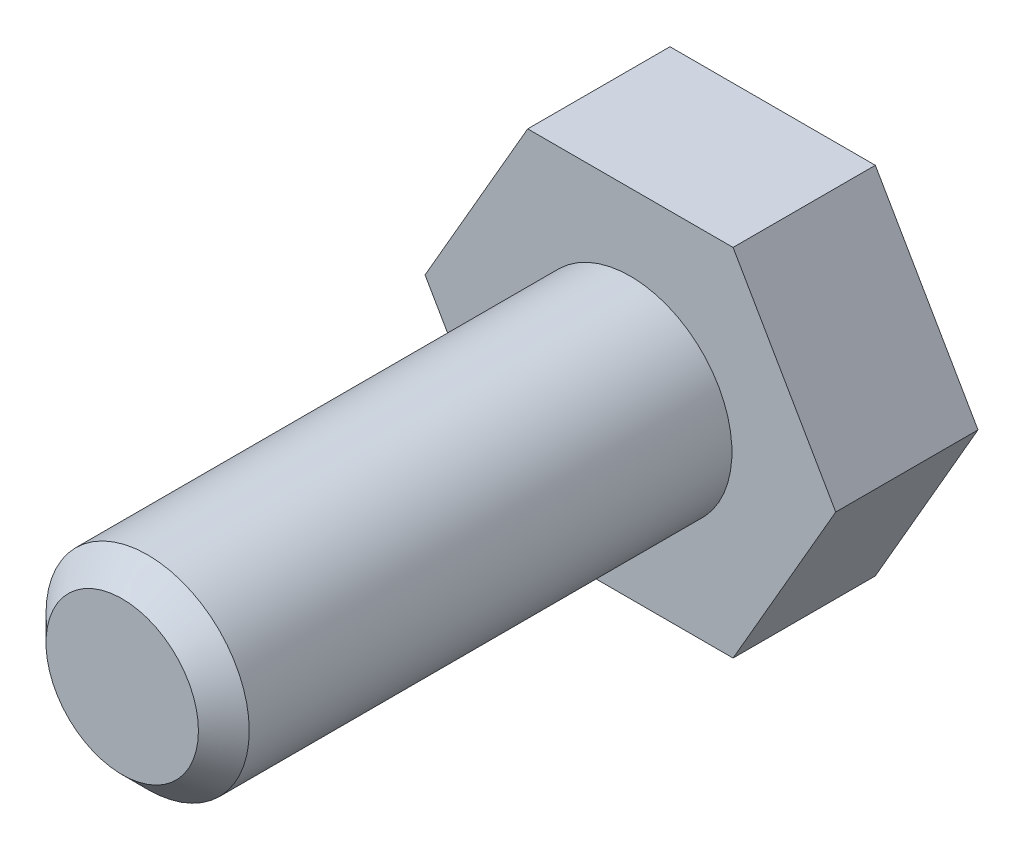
ISO-10303-21;
HEADER;
FILE_DESCRIPTION(('STEP AP214'),'2;1');
FILE_NAME('part.step','',(''),(''),'','','');
FILE_SCHEMA(('AUTOMOTIVE_DESIGN { 1 0 10303 214 1 1 1 1 }'));
ENDSEC;
DATA;
#1=APPLICATION_CONTEXT('core data for automotive mechanical design processes');
#2=APPLICATION_PROTOCOL_DEFINITION('international standard','automotive_design',2000,#1);
#3=PRODUCT_CONTEXT('',#1,'mechanical');
#4=PRODUCT('Part','Part','',(#3));
#5=PRODUCT_RELATED_PRODUCT_CATEGORY('part','',(#4));
#6=PRODUCT_DEFINITION_FORMATION('','',#4);
#7=PRODUCT_DEFINITION_CONTEXT('part definition',#1,'design');
#8=PRODUCT_DEFINITION('design','',#6,#7);
#9=PRODUCT_DEFINITION_SHAPE('','',#8);
#10=(LENGTH_UNIT() NAMED_UNIT(*) SI_UNIT(.MILLI.,.METRE.));
#11=(NAMED_UNIT(*) PLANE_ANGLE_UNIT() SI_UNIT($,.RADIAN.));
#12=(NAMED_UNIT(*) SI_UNIT($,.STERADIAN.) SOLID_ANGLE_UNIT());
#13=UNCERTAINTY_MEASURE_WITH_UNIT(LENGTH_MEASURE(1.E-05),#10,'distance_accuracy_value','');
#14=(GEOMETRIC_REPRESENTATION_CONTEXT(3) GLOBAL_UNCERTAINTY_ASSIGNED_CONTEXT((#13)) GLOBAL_UNIT_ASSIGNED_CONTEXT((#10,
#11,#12)) REPRESENTATION_CONTEXT('',''));
#15=CARTESIAN_POINT('',(0.,0.,0.));
#16=DIRECTION('',(0.,0.,1.));
#17=DIRECTION('',(1.,0.,0.));
#18=AXIS2_PLACEMENT_3D('',#15,#16,#17);
#19=CARTESIAN_POINT('',(0.,0.,2.8));
#20=DIRECTION('',(0.,0.,-1.));
#21=DIRECTION('',(-1.,0.,0.));
#22=AXIS2_PLACEMENT_3D('',#19,#20,#21);
#23=PLANE('',#22);
#24=DIRECTION('',(-0.500000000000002,-0.866025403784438,0.));
#25=VECTOR('',#24,1.);
#26=CARTESIAN_POINT('',(-4.04,0.,2.8));
#27=LINE('',#26,#25);
#28=CARTESIAN_POINT('',(-2.0192740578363,3.5,2.8));
#29=VERTEX_POINT('',#28);
#30=CARTESIAN_POINT('',(-4.04,0.,2.8));
#31=VERTEX_POINT('',#30);
#32=EDGE_CURVE('E131',#29,#31,#27,.T.);
#33=ORIENTED_EDGE('',*,*,#32,.T.);
#34=DIRECTION('',(0.5,-0.866025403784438,0.));
#35=VECTOR('',#34,1.);
#36=CARTESIAN_POINT('',(-2.01927405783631,-3.5,2.8));
#37=LINE('',#36,#35);
#38=CARTESIAN_POINT('',(-2.01927405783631,-3.5,2.8));
#39=VERTEX_POINT('',#38);
#40=EDGE_CURVE('E90',#31,#39,#37,.T.);
#41=ORIENTED_EDGE('',*,*,#40,.T.);
#42=DIRECTION('',(1.,0.,0.));
#43=VECTOR('',#42,1.);
#44=CARTESIAN_POINT('',(-2.01927405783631,-3.5,2.8));
#45=LINE('',#44,#43);
#46=CARTESIAN_POINT('',(2.02217782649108,-3.5,2.8));
#47=VERTEX_POINT('',#46);
#48=EDGE_CURVE('E103',#39,#47,#45,.T.);
#49=ORIENTED_EDGE('',*,*,#48,.T.);
#50=DIRECTION('',(0.500000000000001,0.866025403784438,0.));
#51=VECTOR('',#50,1.);
#52=CARTESIAN_POINT('',(4.04290376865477,0.,2.8));
#53=LINE('',#52,#51);
#54=CARTESIAN_POINT('',(4.04290376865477,0.,2.8));
#55=VERTEX_POINT('',#54);
#56=EDGE_CURVE('E97',#47,#55,#53,.T.);
#57=ORIENTED_EDGE('',*,*,#56,.T.);
#58=DIRECTION('',(-0.500000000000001,0.866025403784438,0.));
#59=VECTOR('',#58,1.);
#60=CARTESIAN_POINT('',(2.02217782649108,3.5,2.8));
#61=LINE('',#60,#59);
#62=CARTESIAN_POINT('',(2.02217782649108,3.5,2.8));
#63=VERTEX_POINT('',#62);
#64=EDGE_CURVE('E101',#55,#63,#61,.T.);
#65=ORIENTED_EDGE('',*,*,#64,.T.);
#66=DIRECTION('',(-1.,0.,0.));
#67=VECTOR('',#66,1.);
#68=CARTESIAN_POINT('',(-2.0192740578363,3.5,2.8));
#69=LINE('',#68,#67);
#70=EDGE_CURVE('E52',#63,#29,#69,.T.);
#71=ORIENTED_EDGE('',*,*,#70,.T.);
#72=EDGE_LOOP('',(#33,#41,#49,#57,#65,#71));
#73=FACE_BOUND('',#72,.T.);
#74=CARTESIAN_POINT('',(0.,0.,2.8));
#75=DIRECTION('',(0.,0.,-1.));
#76=DIRECTION('',(-1.,0.,0.));
#77=AXIS2_PLACEMENT_3D('',#74,#75,#76);
#78=CIRCLE('',#77,2.);
#79=CARTESIAN_POINT('',(-2.,0.,2.8));
#80=VERTEX_POINT('',#79);
#81=EDGE_CURVE('E140',#80,#80,#78,.F.);
#82=ORIENTED_EDGE('',*,*,#81,.F.);
#83=EDGE_LOOP('',(#82));
#84=FACE_BOUND('',#83,.T.);
#85=ADVANCED_FACE('F35',(#73,#84),#23,.F.);
#86=CARTESIAN_POINT('',(-4.04,0.,2.8));
#87=DIRECTION('',(0.866025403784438,-0.500000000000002,0.));
#88=DIRECTION('',(0.500000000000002,0.866025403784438,0.));
#89=AXIS2_PLACEMENT_3D('',#86,#87,#88);
#90=PLANE('',#89);
#91=DIRECTION('',(-0.500000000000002,-0.866025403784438,0.));
#92=VECTOR('',#91,1.);
#93=CARTESIAN_POINT('',(-4.04,0.,0.));
#94=LINE('',#93,#92);
#95=CARTESIAN_POINT('',(-2.0192740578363,3.5,0.));
#96=VERTEX_POINT('',#95);
#97=CARTESIAN_POINT('',(-4.04,0.,0.));
#98=VERTEX_POINT('',#97);
#99=EDGE_CURVE('E121',#96,#98,#94,.T.);
#100=ORIENTED_EDGE('',*,*,#99,.T.);
#101=DIRECTION('',(0.,0.,-1.));
#102=VECTOR('',#101,1.);
#103=CARTESIAN_POINT('',(-4.04,0.,2.8));
#104=LINE('',#103,#102);
#105=EDGE_CURVE('E138',#31,#98,#104,.T.);
#106=ORIENTED_EDGE('',*,*,#105,.F.);
#107=ORIENTED_EDGE('',*,*,#32,.F.);
#108=DIRECTION('',(0.,0.,-1.));
#109=VECTOR('',#108,1.);
#110=CARTESIAN_POINT('',(-2.0192740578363,3.5,2.8));
#111=LINE('',#110,#109);
#112=EDGE_CURVE('E117',#29,#96,#111,.T.);
#113=ORIENTED_EDGE('',*,*,#112,.T.);
#114=EDGE_LOOP('',(#100,#106,#107,#113));
#115=FACE_BOUND('',#114,.T.);
#116=ADVANCED_FACE('F156',(#115),#90,.F.);
#117=CARTESIAN_POINT('',(-2.01927405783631,-3.5,2.8));
#118=DIRECTION('',(0.866025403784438,0.5,0.));
#119=DIRECTION('',(-0.5,0.866025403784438,0.));
#120=AXIS2_PLACEMENT_3D('',#117,#118,#119);
#121=PLANE('',#120);
#122=DIRECTION('',(0.5,-0.866025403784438,0.));
#123=VECTOR('',#122,1.);
#124=CARTESIAN_POINT('',(-2.01927405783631,-3.5,0.));
#125=LINE('',#124,#123);
#126=CARTESIAN_POINT('',(-2.01927405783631,-3.5,0.));
#127=VERTEX_POINT('',#126);
#128=EDGE_CURVE('E124',#98,#127,#125,.T.);
#129=ORIENTED_EDGE('',*,*,#128,.T.);
#130=DIRECTION('',(0.,0.,-1.));
#131=VECTOR('',#130,1.);
#132=CARTESIAN_POINT('',(-2.01927405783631,-3.5,2.8));
#133=LINE('',#132,#131);
#134=EDGE_CURVE('E135',#39,#127,#133,.T.);
#135=ORIENTED_EDGE('',*,*,#134,.F.);
#136=ORIENTED_EDGE('',*,*,#40,.F.);
#137=ORIENTED_EDGE('',*,*,#105,.T.);
#138=EDGE_LOOP('',(#129,#135,#136,#137));
#139=FACE_BOUND('',#138,.T.);
#140=ADVANCED_FACE('F161',(#139),#121,.F.);
#141=CARTESIAN_POINT('',(-2.01927405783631,-3.5,2.8));
#142=DIRECTION('',(0.,1.,0.));
#143=DIRECTION('',(0.,0.,1.));
#144=AXIS2_PLACEMENT_3D('',#141,#142,#143);
#145=PLANE('',#144);
#146=DIRECTION('',(1.,0.,0.));
#147=VECTOR('',#146,1.);
#148=CARTESIAN_POINT('',(-2.01927405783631,-3.5,0.));
#149=LINE('',#148,#147);
#150=CARTESIAN_POINT('',(2.02217782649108,-3.5,0.));
#151=VERTEX_POINT('',#150);
#152=EDGE_CURVE('E126',#127,#151,#149,.T.);
#153=ORIENTED_EDGE('',*,*,#152,.T.);
#154=DIRECTION('',(0.,0.,-1.));
#155=VECTOR('',#154,1.);
#156=CARTESIAN_POINT('',(2.02217782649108,-3.5,2.8));
#157=LINE('',#156,#155);
#158=EDGE_CURVE('E112',#47,#151,#157,.T.);
#159=ORIENTED_EDGE('',*,*,#158,.F.);
#160=ORIENTED_EDGE('',*,*,#48,.F.);
#161=ORIENTED_EDGE('',*,*,#134,.T.);
#162=EDGE_LOOP('',(#153,#159,#160,#161));
#163=FACE_BOUND('',#162,.T.);
#164=ADVANCED_FACE('F176',(#163),#145,.F.);
#165=CARTESIAN_POINT('',(4.04290376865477,0.,2.8));
#166=DIRECTION('',(-0.866025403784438,0.500000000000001,0.));
#167=DIRECTION('',(-0.500000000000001,-0.866025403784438,0.));
#168=AXIS2_PLACEMENT_3D('',#165,#166,#167);
#169=PLANE('',#168);
#170=DIRECTION('',(0.500000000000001,0.866025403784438,0.));
#171=VECTOR('',#170,1.);
#172=CARTESIAN_POINT('',(4.04290376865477,0.,0.));
#173=LINE('',#172,#171);
#174=CARTESIAN_POINT('',(4.04290376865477,0.,0.));
#175=VERTEX_POINT('',#174);
#176=EDGE_CURVE('E111',#151,#175,#173,.T.);
#177=ORIENTED_EDGE('',*,*,#176,.T.);
#178=DIRECTION('',(0.,0.,-1.));
#179=VECTOR('',#178,1.);
#180=CARTESIAN_POINT('',(4.04290376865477,0.,2.8));
#181=LINE('',#180,#179);
#182=EDGE_CURVE('E108',#55,#175,#181,.T.);
#183=ORIENTED_EDGE('',*,*,#182,.F.);
#184=ORIENTED_EDGE('',*,*,#56,.F.);
#185=ORIENTED_EDGE('',*,*,#158,.T.);
#186=EDGE_LOOP('',(#177,#183,#184,#185));
#187=FACE_BOUND('',#186,.T.);
#188=ADVANCED_FACE('F109',(#187),#169,.F.);
#189=CARTESIAN_POINT('',(2.02217782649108,3.5,2.8));
#190=DIRECTION('',(-0.866025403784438,-0.500000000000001,0.));
#191=DIRECTION('',(0.500000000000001,-0.866025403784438,0.));
#192=AXIS2_PLACEMENT_3D('',#189,#190,#191);
#193=PLANE('',#192);
#194=DIRECTION('',(-0.500000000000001,0.866025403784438,0.));
#195=VECTOR('',#194,1.);
#196=CARTESIAN_POINT('',(2.02217782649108,3.5,0.));
#197=LINE('',#196,#195);
#198=CARTESIAN_POINT('',(2.02217782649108,3.5,0.));
#199=VERTEX_POINT('',#198);
#200=EDGE_CURVE('E75',#175,#199,#197,.T.);
#201=ORIENTED_EDGE('',*,*,#200,.T.);
#202=DIRECTION('',(0.,0.,-1.));
#203=VECTOR('',#202,1.);
#204=CARTESIAN_POINT('',(2.02217782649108,3.5,2.8));
#205=LINE('',#204,#203);
#206=EDGE_CURVE('E113',#63,#199,#205,.T.);
#207=ORIENTED_EDGE('',*,*,#206,.F.);
#208=ORIENTED_EDGE('',*,*,#64,.F.);
#209=ORIENTED_EDGE('',*,*,#182,.T.);
#210=EDGE_LOOP('',(#201,#207,#208,#209));
#211=FACE_BOUND('',#210,.T.);
#212=ADVANCED_FACE('F115',(#211),#193,.F.);
#213=CARTESIAN_POINT('',(-2.0192740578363,3.5,2.8));
#214=DIRECTION('',(0.,-1.,0.));
#215=DIRECTION('',(0.,0.,-1.));
#216=AXIS2_PLACEMENT_3D('',#213,#214,#215);
#217=PLANE('',#216);
#218=DIRECTION('',(-1.,0.,0.));
#219=VECTOR('',#218,1.);
#220=CARTESIAN_POINT('',(-2.0192740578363,3.5,0.));
#221=LINE('',#220,#219);
#222=EDGE_CURVE('E81',#199,#96,#221,.T.);
#223=ORIENTED_EDGE('',*,*,#222,.T.);
#224=ORIENTED_EDGE('',*,*,#112,.F.);
#225=ORIENTED_EDGE('',*,*,#70,.F.);
#226=ORIENTED_EDGE('',*,*,#206,.T.);
#227=EDGE_LOOP('',(#223,#224,#225,#226));
#228=FACE_BOUND('',#227,.T.);
#229=ADVANCED_FACE('F168',(#228),#217,.F.);
#230=CARTESIAN_POINT('',(0.,0.,0.));
#231=DIRECTION('',(0.,0.,-1.));
#232=DIRECTION('',(-1.,0.,0.));
#233=AXIS2_PLACEMENT_3D('',#230,#231,#232);
#234=PLANE('',#233);
#235=ORIENTED_EDGE('',*,*,#99,.F.);
#236=ORIENTED_EDGE('',*,*,#222,.F.);
#237=ORIENTED_EDGE('',*,*,#200,.F.);
#238=ORIENTED_EDGE('',*,*,#176,.F.);
#239=ORIENTED_EDGE('',*,*,#152,.F.);
#240=ORIENTED_EDGE('',*,*,#128,.F.);
#241=EDGE_LOOP('',(#235,#236,#237,#238,#239,#240));
#242=FACE_BOUND('',#241,.T.);
#243=ADVANCED_FACE('F165',(#242),#234,.T.);
#244=CARTESIAN_POINT('',(0.,0.,12.8));
#245=DIRECTION('',(0.,0.,-1.));
#246=DIRECTION('',(-1.,0.,0.));
#247=AXIS2_PLACEMENT_3D('',#244,#245,#246);
#248=CYLINDRICAL_SURFACE('',#247,2.);
#249=CARTESIAN_POINT('',(0.,0.,12.3));
#250=DIRECTION('',(0.,0.,1.));
#251=DIRECTION('',(1.,0.,0.));
#252=AXIS2_PLACEMENT_3D('',#249,#250,#251);
#253=CIRCLE('',#252,2.);
#254=CARTESIAN_POINT('',(2.,0.,12.3));
#255=VERTEX_POINT('',#254);
#256=EDGE_CURVE('E11',#255,#255,#253,.F.);
#257=ORIENTED_EDGE('',*,*,#256,.T.);
#258=EDGE_LOOP('',(#257));
#259=FACE_BOUND('',#258,.T.);
#260=ORIENTED_EDGE('',*,*,#81,.T.);
#261=EDGE_LOOP('',(#260));
#262=FACE_BOUND('',#261,.T.);
#263=ADVANCED_FACE('F152',(#259,#262),#248,.T.);
#264=CARTESIAN_POINT('',(0.,0.,12.8));
#265=DIRECTION('',(0.,0.,1.));
#266=DIRECTION('',(1.,0.,0.));
#267=AXIS2_PLACEMENT_3D('',#264,#265,#266);
#268=PLANE('',#267);
#269=CARTESIAN_POINT('',(0.,0.,12.8));
#270=DIRECTION('',(0.,0.,1.));
#271=DIRECTION('',(1.,0.,0.));
#272=AXIS2_PLACEMENT_3D('',#269,#270,#271);
#273=CIRCLE('',#272,1.5);
#274=CARTESIAN_POINT('',(1.5,0.,12.8));
#275=VERTEX_POINT('',#274);
#276=EDGE_CURVE('E44',#275,#275,#273,.T.);
#277=ORIENTED_EDGE('',*,*,#276,.T.);
#278=EDGE_LOOP('',(#277));
#279=FACE_BOUND('',#278,.T.);
#280=ADVANCED_FACE('F145',(#279),#268,.T.);
#281=CARTESIAN_POINT('',(0.,0.,12.8));
#282=DIRECTION('',(0.,0.,-1.));
#283=DIRECTION('',(-1.,0.,0.));
#284=AXIS2_PLACEMENT_3D('',#281,#282,#283);
#285=CONICAL_SURFACE('',#284,1.5,0.785398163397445);
#286=ORIENTED_EDGE('',*,*,#256,.F.);
#287=EDGE_LOOP('',(#286));
#288=FACE_BOUND('',#287,.T.);
#289=ORIENTED_EDGE('',*,*,#276,.F.);
#290=EDGE_LOOP('',(#289));
#291=FACE_BOUND('',#290,.T.);
#292=ADVANCED_FACE('F37',(#288,#291),#285,.T.);
#293=CLOSED_SHELL('',(#85,#116,#140,#164,#188,#212,#229,#243,#263,#280,#292));
#294=MANIFOLD_SOLID_BREP('B2',#293);
#295=ADVANCED_BREP_SHAPE_REPRESENTATION('',(#18,#294),#14);
#296=SHAPE_DEFINITION_REPRESENTATION(#9,#295);
ENDSEC;
END-ISO-10303-21;
